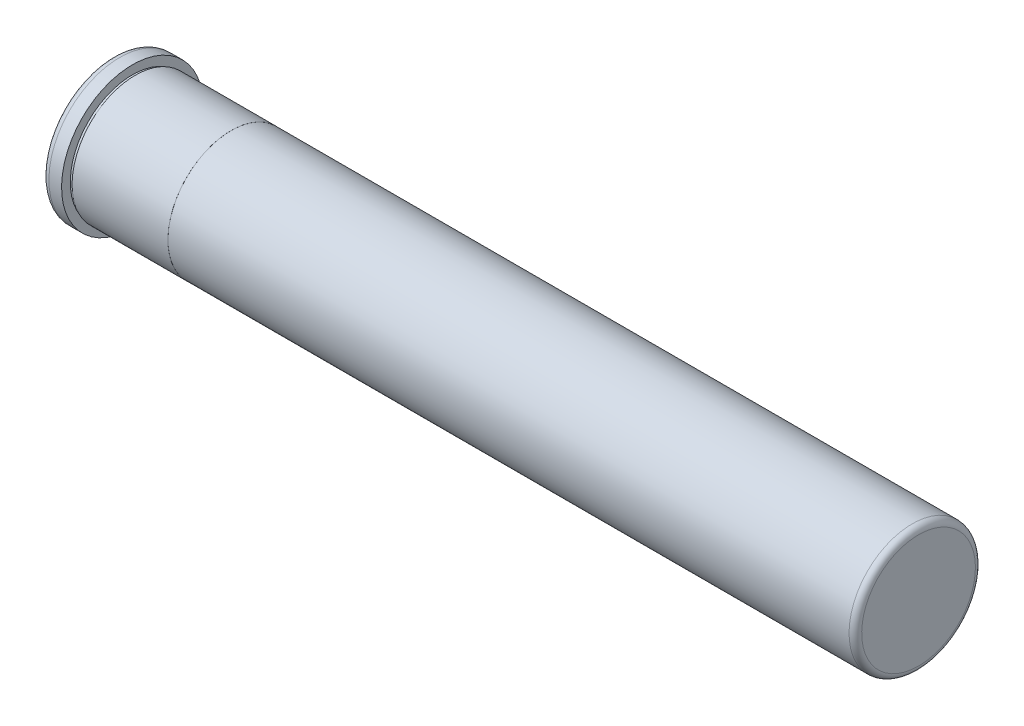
ISO-10303-21;
HEADER;
FILE_DESCRIPTION(('STEP AP214'),'2;1');
FILE_NAME('part.step','',(''),(''),'','','');
FILE_SCHEMA(('AUTOMOTIVE_DESIGN { 1 0 10303 214 1 1 1 1 }'));
ENDSEC;
DATA;
#1=APPLICATION_CONTEXT('core data for automotive mechanical design processes');
#2=APPLICATION_PROTOCOL_DEFINITION('international standard','automotive_design',2000,#1);
#3=PRODUCT_CONTEXT('',#1,'mechanical');
#4=PRODUCT('Part','Part','',(#3));
#5=PRODUCT_RELATED_PRODUCT_CATEGORY('part','',(#4));
#6=PRODUCT_DEFINITION_FORMATION('','',#4);
#7=PRODUCT_DEFINITION_CONTEXT('part definition',#1,'design');
#8=PRODUCT_DEFINITION('design','',#6,#7);
#9=PRODUCT_DEFINITION_SHAPE('','',#8);
#10=(LENGTH_UNIT() NAMED_UNIT(*) SI_UNIT(.MILLI.,.METRE.));
#11=(NAMED_UNIT(*) PLANE_ANGLE_UNIT() SI_UNIT($,.RADIAN.));
#12=(NAMED_UNIT(*) SI_UNIT($,.STERADIAN.) SOLID_ANGLE_UNIT());
#13=UNCERTAINTY_MEASURE_WITH_UNIT(LENGTH_MEASURE(1.E-05),#10,'distance_accuracy_value','');
#14=(GEOMETRIC_REPRESENTATION_CONTEXT(3) GLOBAL_UNCERTAINTY_ASSIGNED_CONTEXT((#13)) GLOBAL_UNIT_ASSIGNED_CONTEXT((#10,
#11,#12)) REPRESENTATION_CONTEXT('',''));
#15=CARTESIAN_POINT('',(0.,0.,0.));
#16=DIRECTION('',(0.,0.,1.));
#17=DIRECTION('',(1.,0.,0.));
#18=AXIS2_PLACEMENT_3D('',#15,#16,#17);
#19=CARTESIAN_POINT('',(320.6623,22.8473,0.));
#20=DIRECTION('',(-1.,0.,0.));
#21=DIRECTION('',(0.,-1.,0.));
#22=AXIS2_PLACEMENT_3D('',#19,#20,#21);
#23=PLANE('',#22);
#24=CARTESIAN_POINT('',(320.6623,0.,0.));
#25=DIRECTION('',(-1.,0.,0.));
#26=DIRECTION('',(0.,-1.,0.));
#27=AXIS2_PLACEMENT_3D('',#24,#25,#26);
#28=CIRCLE('',#27,22.8473);
#29=CARTESIAN_POINT('',(320.6623,-22.8473,0.));
#30=VERTEX_POINT('',#29);
#31=EDGE_CURVE('E10',#30,#30,#28,.T.);
#32=ORIENTED_EDGE('',*,*,#31,.F.);
#33=EDGE_LOOP('',(#32));
#34=FACE_BOUND('',#33,.T.);
#35=ADVANCED_FACE('F28',(#34),#23,.F.);
#36=CARTESIAN_POINT('',(318.1223,0.,0.));
#37=DIRECTION('',(-1.,0.,0.));
#38=DIRECTION('',(0.,-1.,0.));
#39=AXIS2_PLACEMENT_3D('',#36,#37,#38);
#40=TOROIDAL_SURFACE('',#39,22.8473,2.53999999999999);
#41=CARTESIAN_POINT('',(318.1223,0.,0.));
#42=DIRECTION('',(-1.,0.,0.));
#43=DIRECTION('',(0.,-1.,0.));
#44=AXIS2_PLACEMENT_3D('',#41,#42,#43);
#45=CIRCLE('',#44,25.3873);
#46=CARTESIAN_POINT('',(318.1223,-25.3873,0.));
#47=VERTEX_POINT('',#46);
#48=EDGE_CURVE('E34',#47,#47,#45,.T.);
#49=ORIENTED_EDGE('',*,*,#48,.F.);
#50=EDGE_LOOP('',(#49));
#51=FACE_BOUND('',#50,.T.);
#52=ORIENTED_EDGE('',*,*,#31,.T.);
#53=EDGE_LOOP('',(#52));
#54=FACE_BOUND('',#53,.T.);
#55=ADVANCED_FACE('F112',(#51,#54),#40,.T.);
#56=CARTESIAN_POINT('',(320.6623,0.,0.));
#57=DIRECTION('',(-1.,0.,0.));
#58=DIRECTION('',(0.,-1.,0.));
#59=AXIS2_PLACEMENT_3D('',#56,#57,#58);
#60=CYLINDRICAL_SURFACE('',#59,25.3873);
#61=CARTESIAN_POINT('',(44.4373,0.,0.));
#62=DIRECTION('',(-1.,0.,0.));
#63=DIRECTION('',(0.,-1.,0.));
#64=AXIS2_PLACEMENT_3D('',#61,#62,#63);
#65=CIRCLE('',#64,25.3873);
#66=CARTESIAN_POINT('',(44.4373,-25.3873,0.));
#67=VERTEX_POINT('',#66);
#68=EDGE_CURVE('E38',#67,#67,#65,.T.);
#69=ORIENTED_EDGE('',*,*,#68,.F.);
#70=EDGE_LOOP('',(#69));
#71=FACE_BOUND('',#70,.T.);
#72=ORIENTED_EDGE('',*,*,#48,.T.);
#73=EDGE_LOOP('',(#72));
#74=FACE_BOUND('',#73,.T.);
#75=ADVANCED_FACE('F107',(#71,#74),#60,.T.);
#76=CARTESIAN_POINT('',(44.4373,25.4126999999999,0.));
#77=DIRECTION('',(-1.,0.,0.));
#78=DIRECTION('',(0.,-1.,0.));
#79=AXIS2_PLACEMENT_3D('',#76,#77,#78);
#80=PLANE('',#79);
#81=CARTESIAN_POINT('',(44.4373,0.,0.));
#82=DIRECTION('',(-1.,0.,0.));
#83=DIRECTION('',(0.,-1.,0.));
#84=AXIS2_PLACEMENT_3D('',#81,#82,#83);
#85=CIRCLE('',#84,25.4127);
#86=CARTESIAN_POINT('',(44.4373,-25.4127,0.));
#87=VERTEX_POINT('',#86);
#88=EDGE_CURVE('E42',#87,#87,#85,.T.);
#89=ORIENTED_EDGE('',*,*,#88,.F.);
#90=EDGE_LOOP('',(#89));
#91=FACE_BOUND('',#90,.T.);
#92=ORIENTED_EDGE('',*,*,#68,.T.);
#93=EDGE_LOOP('',(#92));
#94=FACE_BOUND('',#93,.T.);
#95=ADVANCED_FACE('F101',(#91,#94),#80,.F.);
#96=CARTESIAN_POINT('',(320.6623,0.,0.));
#97=DIRECTION('',(-1.,0.,0.));
#98=DIRECTION('',(0.,-1.,0.));
#99=AXIS2_PLACEMENT_3D('',#96,#97,#98);
#100=CYLINDRICAL_SURFACE('',#99,25.4127);
#101=CARTESIAN_POINT('',(5.93151671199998,0.,0.));
#102=DIRECTION('',(-1.,0.,0.));
#103=DIRECTION('',(0.,-1.,0.));
#104=AXIS2_PLACEMENT_3D('',#101,#102,#103);
#105=CIRCLE('',#104,25.4127);
#106=CARTESIAN_POINT('',(5.93151671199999,-25.4127,0.));
#107=VERTEX_POINT('',#106);
#108=EDGE_CURVE('E47',#107,#107,#105,.T.);
#109=ORIENTED_EDGE('',*,*,#108,.F.);
#110=EDGE_LOOP('',(#109));
#111=FACE_BOUND('',#110,.T.);
#112=ORIENTED_EDGE('',*,*,#88,.T.);
#113=EDGE_LOOP('',(#112));
#114=FACE_BOUND('',#113,.T.);
#115=ADVANCED_FACE('F95',(#111,#114),#100,.T.);
#116=CARTESIAN_POINT('',(5.931516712,24.947245,0.));
#117=DIRECTION('',(1.,0.,0.));
#118=DIRECTION('',(0.,1.,0.));
#119=AXIS2_PLACEMENT_3D('',#116,#117,#118);
#120=PLANE('',#119);
#121=CARTESIAN_POINT('',(5.93151671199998,0.,0.));
#122=DIRECTION('',(-1.,0.,0.));
#123=DIRECTION('',(0.,-1.,0.));
#124=AXIS2_PLACEMENT_3D('',#121,#122,#123);
#125=CIRCLE('',#124,24.947245);
#126=CARTESIAN_POINT('',(5.93151671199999,-24.947245,0.));
#127=VERTEX_POINT('',#126);
#128=EDGE_CURVE('E50',#127,#127,#125,.T.);
#129=ORIENTED_EDGE('',*,*,#128,.F.);
#130=EDGE_LOOP('',(#129));
#131=FACE_BOUND('',#130,.T.);
#132=ORIENTED_EDGE('',*,*,#108,.T.);
#133=EDGE_LOOP('',(#132));
#134=FACE_BOUND('',#133,.T.);
#135=ADVANCED_FACE('F89',(#131,#134),#120,.F.);
#136=CARTESIAN_POINT('',(320.6623,0.,0.));
#137=DIRECTION('',(-1.,0.,0.));
#138=DIRECTION('',(0.,-1.,0.));
#139=AXIS2_PLACEMENT_3D('',#136,#137,#138);
#140=CYLINDRICAL_SURFACE('',#139,24.947245);
#141=CARTESIAN_POINT('',(4.74980000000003,0.,0.));
#142=DIRECTION('',(-1.,0.,0.));
#143=DIRECTION('',(0.,-1.,0.));
#144=AXIS2_PLACEMENT_3D('',#141,#142,#143);
#145=CIRCLE('',#144,24.947245);
#146=CARTESIAN_POINT('',(4.74980000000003,-24.947245,0.));
#147=VERTEX_POINT('',#146);
#148=EDGE_CURVE('E53',#147,#147,#145,.T.);
#149=ORIENTED_EDGE('',*,*,#148,.F.);
#150=EDGE_LOOP('',(#149));
#151=FACE_BOUND('',#150,.T.);
#152=ORIENTED_EDGE('',*,*,#128,.T.);
#153=EDGE_LOOP('',(#152));
#154=FACE_BOUND('',#153,.T.);
#155=ADVANCED_FACE('F83',(#151,#154),#140,.T.);
#156=CARTESIAN_POINT('',(4.74980000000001,28.448,0.));
#157=DIRECTION('',(-1.,0.,0.));
#158=DIRECTION('',(0.,-1.,0.));
#159=AXIS2_PLACEMENT_3D('',#156,#157,#158);
#160=PLANE('',#159);
#161=CARTESIAN_POINT('',(4.74980000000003,0.,0.));
#162=DIRECTION('',(-1.,0.,0.));
#163=DIRECTION('',(0.,-1.,0.));
#164=AXIS2_PLACEMENT_3D('',#161,#162,#163);
#165=CIRCLE('',#164,28.448);
#166=CARTESIAN_POINT('',(4.74980000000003,-28.448,0.));
#167=VERTEX_POINT('',#166);
#168=EDGE_CURVE('E56',#167,#167,#165,.T.);
#169=ORIENTED_EDGE('',*,*,#168,.F.);
#170=EDGE_LOOP('',(#169));
#171=FACE_BOUND('',#170,.T.);
#172=ORIENTED_EDGE('',*,*,#148,.T.);
#173=EDGE_LOOP('',(#172));
#174=FACE_BOUND('',#173,.T.);
#175=ADVANCED_FACE('F77',(#171,#174),#160,.F.);
#176=CARTESIAN_POINT('',(320.6623,0.,0.));
#177=DIRECTION('',(-1.,0.,0.));
#178=DIRECTION('',(0.,-1.,0.));
#179=AXIS2_PLACEMENT_3D('',#176,#177,#178);
#180=CYLINDRICAL_SURFACE('',#179,28.448);
#181=CARTESIAN_POINT('',(-0.342899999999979,0.,0.));
#182=DIRECTION('',(-1.,0.,0.));
#183=DIRECTION('',(0.,-1.,0.));
#184=AXIS2_PLACEMENT_3D('',#181,#182,#183);
#185=CIRCLE('',#184,28.448);
#186=CARTESIAN_POINT('',(-0.342899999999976,-28.448,0.));
#187=VERTEX_POINT('',#186);
#188=EDGE_CURVE('E59',#187,#187,#185,.T.);
#189=ORIENTED_EDGE('',*,*,#188,.F.);
#190=EDGE_LOOP('',(#189));
#191=FACE_BOUND('',#190,.T.);
#192=ORIENTED_EDGE('',*,*,#168,.T.);
#193=EDGE_LOOP('',(#192));
#194=FACE_BOUND('',#193,.T.);
#195=ADVANCED_FACE('F71',(#191,#194),#180,.T.);
#196=CARTESIAN_POINT('',(-0.342899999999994,0.,0.));
#197=DIRECTION('',(-1.,0.,0.));
#198=DIRECTION('',(0.,-1.,0.));
#199=AXIS2_PLACEMENT_3D('',#196,#197,#198);
#200=TOROIDAL_SURFACE('',#199,25.6032,2.8448);
#201=CARTESIAN_POINT('',(-3.18770000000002,0.,0.));
#202=DIRECTION('',(-1.,0.,0.));
#203=DIRECTION('',(0.,-1.,0.));
#204=AXIS2_PLACEMENT_3D('',#201,#202,#203);
#205=CIRCLE('',#204,25.6032);
#206=CARTESIAN_POINT('',(-3.18770000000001,-25.6032,0.));
#207=VERTEX_POINT('',#206);
#208=EDGE_CURVE('E62',#207,#207,#205,.T.);
#209=ORIENTED_EDGE('',*,*,#208,.F.);
#210=EDGE_LOOP('',(#209));
#211=FACE_BOUND('',#210,.T.);
#212=ORIENTED_EDGE('',*,*,#188,.T.);
#213=EDGE_LOOP('',(#212));
#214=FACE_BOUND('',#213,.T.);
#215=ADVANCED_FACE('F68',(#211,#214),#200,.T.);
#216=CARTESIAN_POINT('',(-3.1877,0.,0.));
#217=DIRECTION('',(1.,0.,0.));
#218=DIRECTION('',(0.,1.,0.));
#219=AXIS2_PLACEMENT_3D('',#216,#217,#218);
#220=PLANE('',#219);
#221=ORIENTED_EDGE('',*,*,#208,.T.);
#222=EDGE_LOOP('',(#221));
#223=FACE_BOUND('',#222,.T.);
#224=ADVANCED_FACE('F66',(#223),#220,.F.);
#225=CLOSED_SHELL('',(#35,#55,#75,#95,#115,#135,#155,#175,#195,#215,#224));
#226=MANIFOLD_SOLID_BREP('B2',#225);
#227=ADVANCED_BREP_SHAPE_REPRESENTATION('',(#18,#226),#14);
#228=SHAPE_DEFINITION_REPRESENTATION(#9,#227);
ENDSEC;
END-ISO-10303-21;
